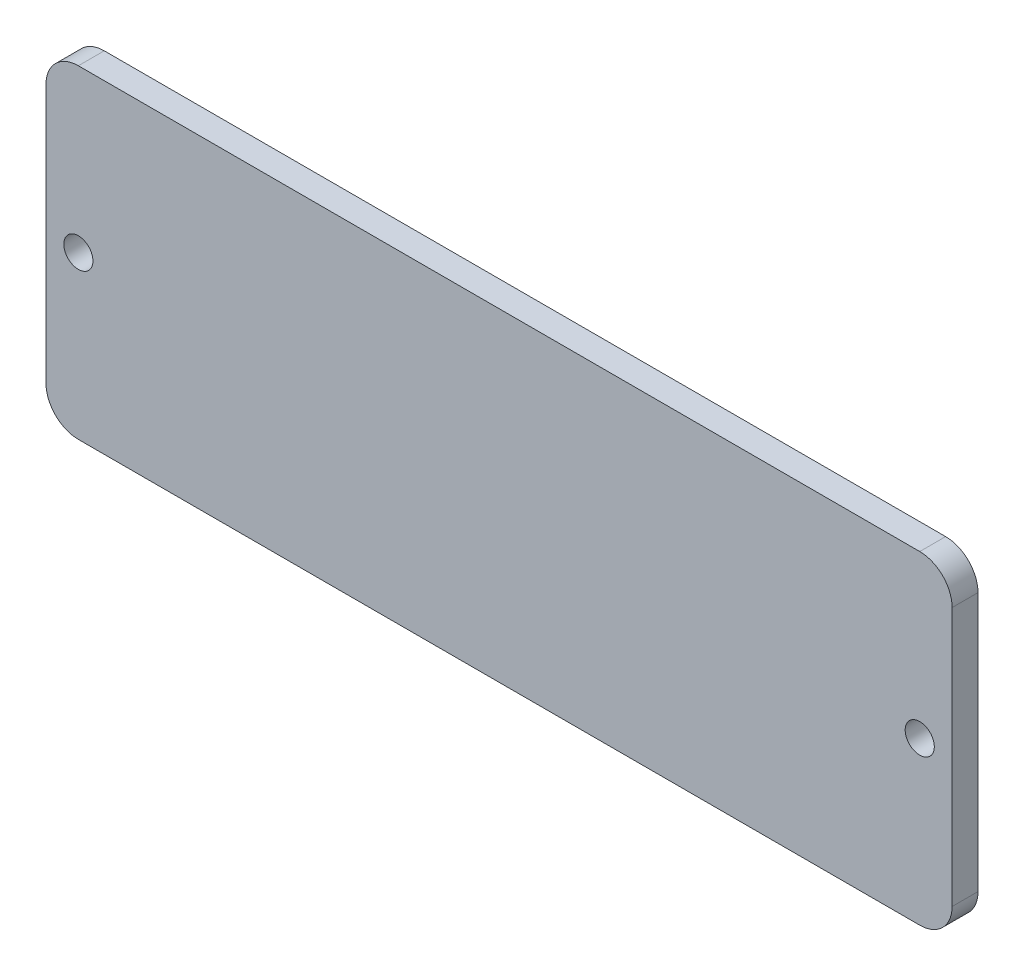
ISO-10303-21;
HEADER;
FILE_DESCRIPTION(('STEP AP214'),'2;1');
FILE_NAME('part.step','',(''),(''),'','','');
FILE_SCHEMA(('AUTOMOTIVE_DESIGN { 1 0 10303 214 1 1 1 1 }'));
ENDSEC;
DATA;
#1=APPLICATION_CONTEXT('core data for automotive mechanical design processes');
#2=APPLICATION_PROTOCOL_DEFINITION('international standard','automotive_design',2000,#1);
#3=PRODUCT_CONTEXT('',#1,'mechanical');
#4=PRODUCT('Part','Part','',(#3));
#5=PRODUCT_RELATED_PRODUCT_CATEGORY('part','',(#4));
#6=PRODUCT_DEFINITION_FORMATION('','',#4);
#7=PRODUCT_DEFINITION_CONTEXT('part definition',#1,'design');
#8=PRODUCT_DEFINITION('design','',#6,#7);
#9=PRODUCT_DEFINITION_SHAPE('','',#8);
#10=(LENGTH_UNIT() NAMED_UNIT(*) SI_UNIT(.MILLI.,.METRE.));
#11=(NAMED_UNIT(*) PLANE_ANGLE_UNIT() SI_UNIT($,.RADIAN.));
#12=(NAMED_UNIT(*) SI_UNIT($,.STERADIAN.) SOLID_ANGLE_UNIT());
#13=UNCERTAINTY_MEASURE_WITH_UNIT(LENGTH_MEASURE(1.E-05),#10,'distance_accuracy_value','');
#14=(GEOMETRIC_REPRESENTATION_CONTEXT(3) GLOBAL_UNCERTAINTY_ASSIGNED_CONTEXT((#13)) GLOBAL_UNIT_ASSIGNED_CONTEXT((#10,
#11,#12)) REPRESENTATION_CONTEXT('',''));
#15=CARTESIAN_POINT('',(0.,0.,0.));
#16=DIRECTION('',(0.,0.,1.));
#17=DIRECTION('',(1.,0.,0.));
#18=AXIS2_PLACEMENT_3D('',#15,#16,#17);
#19=CARTESIAN_POINT('',(0.,50.,4.));
#20=DIRECTION('',(0.,0.,-1.));
#21=DIRECTION('',(-1.,0.,0.));
#22=AXIS2_PLACEMENT_3D('',#19,#20,#21);
#23=PLANE('',#22);
#24=DIRECTION('',(0.,-1.,0.));
#25=VECTOR('',#24,1.);
#26=CARTESIAN_POINT('',(0.,0.,4.));
#27=LINE('',#26,#25);
#28=CARTESIAN_POINT('',(0.,45.,4.));
#29=VERTEX_POINT('',#28);
#30=CARTESIAN_POINT('',(0.,5.,4.));
#31=VERTEX_POINT('',#30);
#32=EDGE_CURVE('E136',#29,#31,#27,.T.);
#33=ORIENTED_EDGE('',*,*,#32,.T.);
#34=CARTESIAN_POINT('',(5.,5.,4.));
#35=DIRECTION('',(0.,0.,-1.));
#36=DIRECTION('',(-1.,0.,0.));
#37=AXIS2_PLACEMENT_3D('',#34,#35,#36);
#38=CIRCLE('',#37,5.);
#39=CARTESIAN_POINT('',(5.,0.,4.));
#40=VERTEX_POINT('',#39);
#41=EDGE_CURVE('E151',#31,#40,#38,.F.);
#42=ORIENTED_EDGE('',*,*,#41,.T.);
#43=DIRECTION('',(1.,0.,0.));
#44=VECTOR('',#43,1.);
#45=CARTESIAN_POINT('',(0.,0.,4.));
#46=LINE('',#45,#44);
#47=CARTESIAN_POINT('',(135.,0.,4.));
#48=VERTEX_POINT('',#47);
#49=EDGE_CURVE('E118',#40,#48,#46,.T.);
#50=ORIENTED_EDGE('',*,*,#49,.T.);
#51=CARTESIAN_POINT('',(135.,5.,4.));
#52=DIRECTION('',(0.,0.,-1.));
#53=DIRECTION('',(-1.,0.,0.));
#54=AXIS2_PLACEMENT_3D('',#51,#52,#53);
#55=CIRCLE('',#54,5.);
#56=CARTESIAN_POINT('',(140.,5.,4.));
#57=VERTEX_POINT('',#56);
#58=EDGE_CURVE('E149',#48,#57,#55,.F.);
#59=ORIENTED_EDGE('',*,*,#58,.T.);
#60=DIRECTION('',(0.,1.,0.));
#61=VECTOR('',#60,1.);
#62=CARTESIAN_POINT('',(140.,0.,4.));
#63=LINE('',#62,#61);
#64=CARTESIAN_POINT('',(140.,45.,4.));
#65=VERTEX_POINT('',#64);
#66=EDGE_CURVE('E162',#57,#65,#63,.T.);
#67=ORIENTED_EDGE('',*,*,#66,.T.);
#68=CARTESIAN_POINT('',(135.,45.,4.));
#69=DIRECTION('',(0.,0.,-1.));
#70=DIRECTION('',(-1.,0.,0.));
#71=AXIS2_PLACEMENT_3D('',#68,#69,#70);
#72=CIRCLE('',#71,5.);
#73=CARTESIAN_POINT('',(135.,50.,4.));
#74=VERTEX_POINT('',#73);
#75=EDGE_CURVE('E53',#65,#74,#72,.F.);
#76=ORIENTED_EDGE('',*,*,#75,.T.);
#77=DIRECTION('',(-1.,0.,0.));
#78=VECTOR('',#77,1.);
#79=CARTESIAN_POINT('',(0.,50.,4.));
#80=LINE('',#79,#78);
#81=CARTESIAN_POINT('',(5.,50.,4.));
#82=VERTEX_POINT('',#81);
#83=EDGE_CURVE('E137',#74,#82,#80,.T.);
#84=ORIENTED_EDGE('',*,*,#83,.T.);
#85=CARTESIAN_POINT('',(5.,45.,4.));
#86=DIRECTION('',(0.,0.,-1.));
#87=DIRECTION('',(-1.,0.,0.));
#88=AXIS2_PLACEMENT_3D('',#85,#86,#87);
#89=CIRCLE('',#88,5.);
#90=EDGE_CURVE('E146',#82,#29,#89,.F.);
#91=ORIENTED_EDGE('',*,*,#90,.T.);
#92=EDGE_LOOP('',(#33,#42,#50,#59,#67,#76,#84,#91));
#93=FACE_BOUND('',#92,.T.);
#94=CARTESIAN_POINT('',(5.,25.,4.));
#95=DIRECTION('',(0.,0.,1.));
#96=DIRECTION('',(1.,0.,0.));
#97=AXIS2_PLACEMENT_3D('',#94,#95,#96);
#98=CIRCLE('',#97,2.25);
#99=CARTESIAN_POINT('',(7.25,25.,4.));
#100=VERTEX_POINT('',#99);
#101=EDGE_CURVE('E131',#100,#100,#98,.T.);
#102=ORIENTED_EDGE('',*,*,#101,.F.);
#103=EDGE_LOOP('',(#102));
#104=FACE_BOUND('',#103,.T.);
#105=CARTESIAN_POINT('',(135.,25.,4.));
#106=DIRECTION('',(0.,0.,1.));
#107=DIRECTION('',(1.,0.,0.));
#108=AXIS2_PLACEMENT_3D('',#105,#106,#107);
#109=CIRCLE('',#108,2.24999999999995);
#110=CARTESIAN_POINT('',(137.25,25.,4.));
#111=VERTEX_POINT('',#110);
#112=EDGE_CURVE('E179',#111,#111,#109,.T.);
#113=ORIENTED_EDGE('',*,*,#112,.F.);
#114=EDGE_LOOP('',(#113));
#115=FACE_BOUND('',#114,.T.);
#116=ADVANCED_FACE('F32',(#93,#104,#115),#23,.F.);
#117=CARTESIAN_POINT('',(0.,50.,0.));
#118=DIRECTION('',(0.,0.,-1.));
#119=DIRECTION('',(-1.,0.,0.));
#120=AXIS2_PLACEMENT_3D('',#117,#118,#119);
#121=PLANE('',#120);
#122=CARTESIAN_POINT('',(5.,25.,0.));
#123=DIRECTION('',(0.,0.,1.));
#124=DIRECTION('',(1.,0.,0.));
#125=AXIS2_PLACEMENT_3D('',#122,#123,#124);
#126=CIRCLE('',#125,2.25);
#127=CARTESIAN_POINT('',(7.25,25.,0.));
#128=VERTEX_POINT('',#127);
#129=EDGE_CURVE('E176',#128,#128,#126,.T.);
#130=ORIENTED_EDGE('',*,*,#129,.T.);
#131=EDGE_LOOP('',(#130));
#132=FACE_BOUND('',#131,.T.);
#133=DIRECTION('',(1.,0.,0.));
#134=VECTOR('',#133,1.);
#135=CARTESIAN_POINT('',(0.,0.,0.));
#136=LINE('',#135,#134);
#137=CARTESIAN_POINT('',(5.,0.,0.));
#138=VERTEX_POINT('',#137);
#139=CARTESIAN_POINT('',(135.,0.,0.));
#140=VERTEX_POINT('',#139);
#141=EDGE_CURVE('E115',#138,#140,#136,.T.);
#142=ORIENTED_EDGE('',*,*,#141,.F.);
#143=CARTESIAN_POINT('',(5.,5.,0.));
#144=DIRECTION('',(0.,0.,-1.));
#145=DIRECTION('',(-1.,0.,0.));
#146=AXIS2_PLACEMENT_3D('',#143,#144,#145);
#147=CIRCLE('',#146,5.);
#148=CARTESIAN_POINT('',(0.,5.,0.));
#149=VERTEX_POINT('',#148);
#150=EDGE_CURVE('E98',#138,#149,#147,.T.);
#151=ORIENTED_EDGE('',*,*,#150,.T.);
#152=DIRECTION('',(0.,-1.,0.));
#153=VECTOR('',#152,1.);
#154=CARTESIAN_POINT('',(0.,0.,0.));
#155=LINE('',#154,#153);
#156=CARTESIAN_POINT('',(0.,45.,0.));
#157=VERTEX_POINT('',#156);
#158=EDGE_CURVE('E126',#157,#149,#155,.T.);
#159=ORIENTED_EDGE('',*,*,#158,.F.);
#160=CARTESIAN_POINT('',(5.,45.,0.));
#161=DIRECTION('',(0.,0.,-1.));
#162=DIRECTION('',(-1.,0.,0.));
#163=AXIS2_PLACEMENT_3D('',#160,#161,#162);
#164=CIRCLE('',#163,5.);
#165=CARTESIAN_POINT('',(5.,50.,0.));
#166=VERTEX_POINT('',#165);
#167=EDGE_CURVE('E119',#157,#166,#164,.T.);
#168=ORIENTED_EDGE('',*,*,#167,.T.);
#169=DIRECTION('',(-1.,0.,0.));
#170=VECTOR('',#169,1.);
#171=CARTESIAN_POINT('',(0.,50.,0.));
#172=LINE('',#171,#170);
#173=CARTESIAN_POINT('',(135.,50.,0.));
#174=VERTEX_POINT('',#173);
#175=EDGE_CURVE('E129',#174,#166,#172,.T.);
#176=ORIENTED_EDGE('',*,*,#175,.F.);
#177=CARTESIAN_POINT('',(135.,45.,0.));
#178=DIRECTION('',(0.,0.,-1.));
#179=DIRECTION('',(-1.,0.,0.));
#180=AXIS2_PLACEMENT_3D('',#177,#178,#179);
#181=CIRCLE('',#180,5.);
#182=CARTESIAN_POINT('',(140.,45.,0.));
#183=VERTEX_POINT('',#182);
#184=EDGE_CURVE('E140',#174,#183,#181,.T.);
#185=ORIENTED_EDGE('',*,*,#184,.T.);
#186=DIRECTION('',(0.,1.,0.));
#187=VECTOR('',#186,1.);
#188=CARTESIAN_POINT('',(140.,0.,0.));
#189=LINE('',#188,#187);
#190=CARTESIAN_POINT('',(140.,5.,0.));
#191=VERTEX_POINT('',#190);
#192=EDGE_CURVE('E125',#191,#183,#189,.T.);
#193=ORIENTED_EDGE('',*,*,#192,.F.);
#194=CARTESIAN_POINT('',(135.,5.,0.));
#195=DIRECTION('',(0.,0.,-1.));
#196=DIRECTION('',(-1.,0.,0.));
#197=AXIS2_PLACEMENT_3D('',#194,#195,#196);
#198=CIRCLE('',#197,5.);
#199=EDGE_CURVE('E109',#191,#140,#198,.T.);
#200=ORIENTED_EDGE('',*,*,#199,.T.);
#201=EDGE_LOOP('',(#142,#151,#159,#168,#176,#185,#193,#200));
#202=FACE_BOUND('',#201,.T.);
#203=CARTESIAN_POINT('',(135.,25.,0.));
#204=DIRECTION('',(0.,0.,1.));
#205=DIRECTION('',(1.,0.,0.));
#206=AXIS2_PLACEMENT_3D('',#203,#204,#205);
#207=CIRCLE('',#206,2.24999999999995);
#208=CARTESIAN_POINT('',(137.25,25.,0.));
#209=VERTEX_POINT('',#208);
#210=EDGE_CURVE('E182',#209,#209,#207,.T.);
#211=ORIENTED_EDGE('',*,*,#210,.T.);
#212=EDGE_LOOP('',(#211));
#213=FACE_BOUND('',#212,.T.);
#214=ADVANCED_FACE('F122',(#132,#202,#213),#121,.T.);
#215=CARTESIAN_POINT('',(0.,0.,4.));
#216=DIRECTION('',(1.,0.,0.));
#217=DIRECTION('',(0.,0.,-1.));
#218=AXIS2_PLACEMENT_3D('',#215,#216,#217);
#219=PLANE('',#218);
#220=ORIENTED_EDGE('',*,*,#158,.T.);
#221=DIRECTION('',(0.,0.,-1.));
#222=VECTOR('',#221,1.);
#223=CARTESIAN_POINT('',(0.,5.,4.));
#224=LINE('',#223,#222);
#225=EDGE_CURVE('E103',#149,#31,#224,.F.);
#226=ORIENTED_EDGE('',*,*,#225,.T.);
#227=ORIENTED_EDGE('',*,*,#32,.F.);
#228=DIRECTION('',(0.,0.,-1.));
#229=VECTOR('',#228,1.);
#230=CARTESIAN_POINT('',(0.,45.,4.));
#231=LINE('',#230,#229);
#232=EDGE_CURVE('E108',#29,#157,#231,.T.);
#233=ORIENTED_EDGE('',*,*,#232,.T.);
#234=EDGE_LOOP('',(#220,#226,#227,#233));
#235=FACE_BOUND('',#234,.T.);
#236=ADVANCED_FACE('F196',(#235),#219,.F.);
#237=CARTESIAN_POINT('',(0.,0.,4.));
#238=DIRECTION('',(0.,1.,0.));
#239=DIRECTION('',(0.,0.,1.));
#240=AXIS2_PLACEMENT_3D('',#237,#238,#239);
#241=PLANE('',#240);
#242=ORIENTED_EDGE('',*,*,#49,.F.);
#243=DIRECTION('',(0.,0.,-1.));
#244=VECTOR('',#243,1.);
#245=CARTESIAN_POINT('',(5.,0.,4.));
#246=LINE('',#245,#244);
#247=EDGE_CURVE('E102',#40,#138,#246,.T.);
#248=ORIENTED_EDGE('',*,*,#247,.T.);
#249=ORIENTED_EDGE('',*,*,#141,.T.);
#250=DIRECTION('',(0.,0.,-1.));
#251=VECTOR('',#250,1.);
#252=CARTESIAN_POINT('',(135.,0.,4.));
#253=LINE('',#252,#251);
#254=EDGE_CURVE('E120',#140,#48,#253,.F.);
#255=ORIENTED_EDGE('',*,*,#254,.T.);
#256=EDGE_LOOP('',(#242,#248,#249,#255));
#257=FACE_BOUND('',#256,.T.);
#258=ADVANCED_FACE('F114',(#257),#241,.F.);
#259=CARTESIAN_POINT('',(140.,0.,4.));
#260=DIRECTION('',(-1.,0.,0.));
#261=DIRECTION('',(0.,0.,1.));
#262=AXIS2_PLACEMENT_3D('',#259,#260,#261);
#263=PLANE('',#262);
#264=ORIENTED_EDGE('',*,*,#66,.F.);
#265=DIRECTION('',(0.,0.,-1.));
#266=VECTOR('',#265,1.);
#267=CARTESIAN_POINT('',(140.,5.,4.));
#268=LINE('',#267,#266);
#269=EDGE_CURVE('E155',#57,#191,#268,.T.);
#270=ORIENTED_EDGE('',*,*,#269,.T.);
#271=ORIENTED_EDGE('',*,*,#192,.T.);
#272=DIRECTION('',(0.,0.,-1.));
#273=VECTOR('',#272,1.);
#274=CARTESIAN_POINT('',(140.,45.,4.));
#275=LINE('',#274,#273);
#276=EDGE_CURVE('E153',#183,#65,#275,.F.);
#277=ORIENTED_EDGE('',*,*,#276,.T.);
#278=EDGE_LOOP('',(#264,#270,#271,#277));
#279=FACE_BOUND('',#278,.T.);
#280=ADVANCED_FACE('F160',(#279),#263,.F.);
#281=CARTESIAN_POINT('',(0.,50.,4.));
#282=DIRECTION('',(0.,-1.,0.));
#283=DIRECTION('',(0.,0.,-1.));
#284=AXIS2_PLACEMENT_3D('',#281,#282,#283);
#285=PLANE('',#284);
#286=ORIENTED_EDGE('',*,*,#83,.F.);
#287=DIRECTION('',(0.,0.,-1.));
#288=VECTOR('',#287,1.);
#289=CARTESIAN_POINT('',(135.,50.,4.));
#290=LINE('',#289,#288);
#291=EDGE_CURVE('E11',#74,#174,#290,.T.);
#292=ORIENTED_EDGE('',*,*,#291,.T.);
#293=ORIENTED_EDGE('',*,*,#175,.T.);
#294=DIRECTION('',(0.,0.,-1.));
#295=VECTOR('',#294,1.);
#296=CARTESIAN_POINT('',(5.,50.,4.));
#297=LINE('',#296,#295);
#298=EDGE_CURVE('E40',#166,#82,#297,.F.);
#299=ORIENTED_EDGE('',*,*,#298,.T.);
#300=EDGE_LOOP('',(#286,#292,#293,#299));
#301=FACE_BOUND('',#300,.T.);
#302=ADVANCED_FACE('F169',(#301),#285,.F.);
#303=CARTESIAN_POINT('',(5.,25.,4.));
#304=DIRECTION('',(0.,0.,-1.));
#305=DIRECTION('',(-1.,0.,0.));
#306=AXIS2_PLACEMENT_3D('',#303,#304,#305);
#307=CYLINDRICAL_SURFACE('',#306,2.25);
#308=ORIENTED_EDGE('',*,*,#101,.T.);
#309=EDGE_LOOP('',(#308));
#310=FACE_BOUND('',#309,.T.);
#311=ORIENTED_EDGE('',*,*,#129,.F.);
#312=EDGE_LOOP('',(#311));
#313=FACE_BOUND('',#312,.T.);
#314=ADVANCED_FACE('F201',(#310,#313),#307,.F.);
#315=CARTESIAN_POINT('',(135.,25.,4.));
#316=DIRECTION('',(0.,0.,-1.));
#317=DIRECTION('',(-1.,0.,0.));
#318=AXIS2_PLACEMENT_3D('',#315,#316,#317);
#319=CYLINDRICAL_SURFACE('',#318,2.24999999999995);
#320=ORIENTED_EDGE('',*,*,#112,.T.);
#321=EDGE_LOOP('',(#320));
#322=FACE_BOUND('',#321,.T.);
#323=ORIENTED_EDGE('',*,*,#210,.F.);
#324=EDGE_LOOP('',(#323));
#325=FACE_BOUND('',#324,.T.);
#326=ADVANCED_FACE('F188',(#322,#325),#319,.F.);
#327=CARTESIAN_POINT('',(5.,5.,4.));
#328=DIRECTION('',(0.,0.,-1.));
#329=DIRECTION('',(-1.,0.,0.));
#330=AXIS2_PLACEMENT_3D('',#327,#328,#329);
#331=CYLINDRICAL_SURFACE('',#330,5.);
#332=ORIENTED_EDGE('',*,*,#41,.F.);
#333=ORIENTED_EDGE('',*,*,#225,.F.);
#334=ORIENTED_EDGE('',*,*,#150,.F.);
#335=ORIENTED_EDGE('',*,*,#247,.F.);
#336=EDGE_LOOP('',(#332,#333,#334,#335));
#337=FACE_BOUND('',#336,.T.);
#338=ADVANCED_FACE('F101',(#337),#331,.T.);
#339=CARTESIAN_POINT('',(135.,5.,4.));
#340=DIRECTION('',(0.,0.,-1.));
#341=DIRECTION('',(-1.,0.,0.));
#342=AXIS2_PLACEMENT_3D('',#339,#340,#341);
#343=CYLINDRICAL_SURFACE('',#342,5.);
#344=ORIENTED_EDGE('',*,*,#58,.F.);
#345=ORIENTED_EDGE('',*,*,#254,.F.);
#346=ORIENTED_EDGE('',*,*,#199,.F.);
#347=ORIENTED_EDGE('',*,*,#269,.F.);
#348=EDGE_LOOP('',(#344,#345,#346,#347));
#349=FACE_BOUND('',#348,.T.);
#350=ADVANCED_FACE('F215',(#349),#343,.T.);
#351=CARTESIAN_POINT('',(135.,45.,4.));
#352=DIRECTION('',(0.,0.,-1.));
#353=DIRECTION('',(-1.,0.,0.));
#354=AXIS2_PLACEMENT_3D('',#351,#352,#353);
#355=CYLINDRICAL_SURFACE('',#354,5.);
#356=ORIENTED_EDGE('',*,*,#75,.F.);
#357=ORIENTED_EDGE('',*,*,#276,.F.);
#358=ORIENTED_EDGE('',*,*,#184,.F.);
#359=ORIENTED_EDGE('',*,*,#291,.F.);
#360=EDGE_LOOP('',(#356,#357,#358,#359));
#361=FACE_BOUND('',#360,.T.);
#362=ADVANCED_FACE('F168',(#361),#355,.T.);
#363=CARTESIAN_POINT('',(5.,45.,4.));
#364=DIRECTION('',(0.,0.,-1.));
#365=DIRECTION('',(-1.,0.,0.));
#366=AXIS2_PLACEMENT_3D('',#363,#364,#365);
#367=CYLINDRICAL_SURFACE('',#366,5.);
#368=ORIENTED_EDGE('',*,*,#90,.F.);
#369=ORIENTED_EDGE('',*,*,#298,.F.);
#370=ORIENTED_EDGE('',*,*,#167,.F.);
#371=ORIENTED_EDGE('',*,*,#232,.F.);
#372=EDGE_LOOP('',(#368,#369,#370,#371));
#373=FACE_BOUND('',#372,.T.);
#374=ADVANCED_FACE('F34',(#373),#367,.T.);
#375=CLOSED_SHELL('',(#116,#214,#236,#258,#280,#302,#314,#326,#338,#350,#362,#374));
#376=MANIFOLD_SOLID_BREP('B2',#375);
#377=ADVANCED_BREP_SHAPE_REPRESENTATION('',(#18,#376),#14);
#378=SHAPE_DEFINITION_REPRESENTATION(#9,#377);
ENDSEC;
END-ISO-10303-21;
